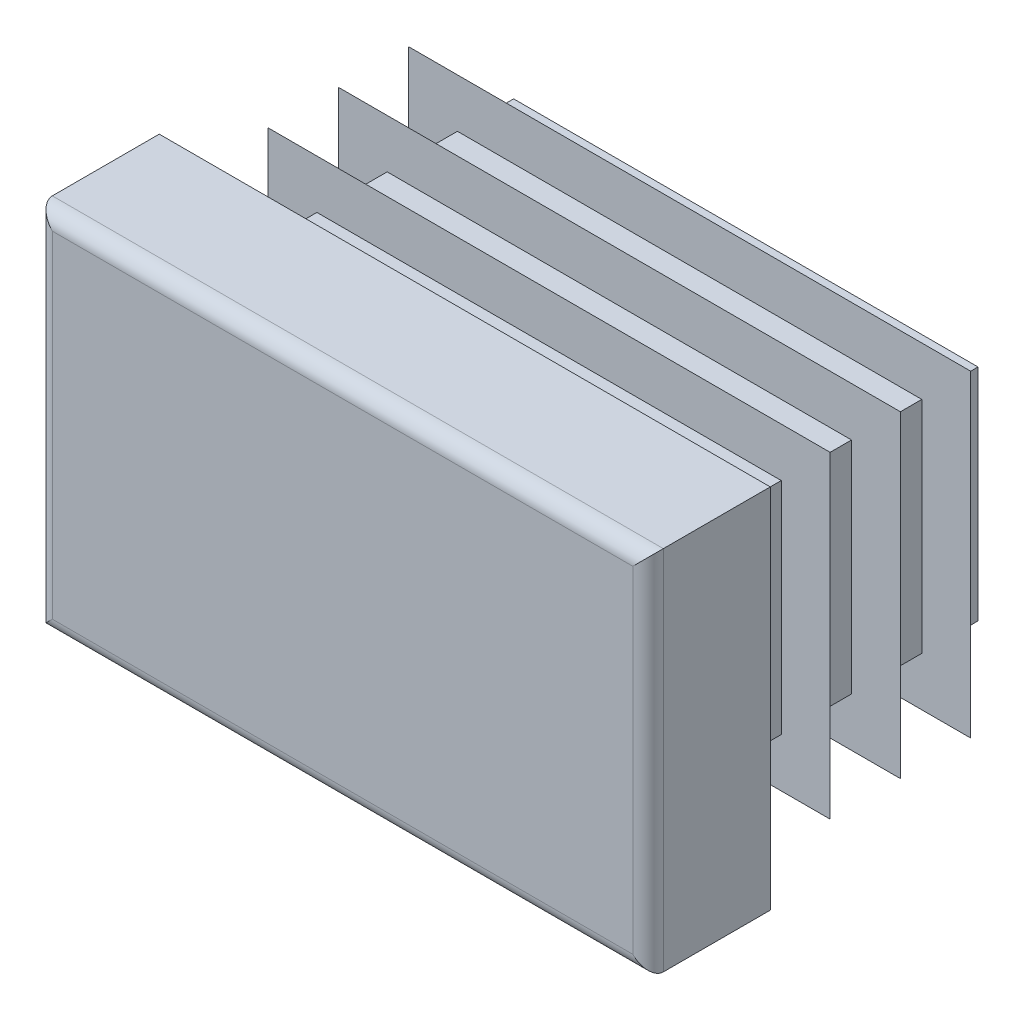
ISO-10303-21;
HEADER;
FILE_DESCRIPTION(('STEP AP214'),'2;1');
FILE_NAME('part.step','',(''),(''),'','','');
FILE_SCHEMA(('AUTOMOTIVE_DESIGN { 1 0 10303 214 1 1 1 1 }'));
ENDSEC;
DATA;
#1=APPLICATION_CONTEXT('core data for automotive mechanical design processes');
#2=APPLICATION_PROTOCOL_DEFINITION('international standard','automotive_design',2000,#1);
#3=PRODUCT_CONTEXT('',#1,'mechanical');
#4=PRODUCT('Part','Part','',(#3));
#5=PRODUCT_RELATED_PRODUCT_CATEGORY('part','',(#4));
#6=PRODUCT_DEFINITION_FORMATION('','',#4);
#7=PRODUCT_DEFINITION_CONTEXT('part definition',#1,'design');
#8=PRODUCT_DEFINITION('design','',#6,#7);
#9=PRODUCT_DEFINITION_SHAPE('','',#8);
#10=(LENGTH_UNIT() NAMED_UNIT(*) SI_UNIT(.MILLI.,.METRE.));
#11=(NAMED_UNIT(*) PLANE_ANGLE_UNIT() SI_UNIT($,.RADIAN.));
#12=(NAMED_UNIT(*) SI_UNIT($,.STERADIAN.) SOLID_ANGLE_UNIT());
#13=UNCERTAINTY_MEASURE_WITH_UNIT(LENGTH_MEASURE(1.E-05),#10,'distance_accuracy_value','');
#14=(GEOMETRIC_REPRESENTATION_CONTEXT(3) GLOBAL_UNCERTAINTY_ASSIGNED_CONTEXT((#13)) GLOBAL_UNIT_ASSIGNED_CONTEXT((#10,
#11,#12)) REPRESENTATION_CONTEXT('',''));
#15=CARTESIAN_POINT('',(0.,0.,0.));
#16=DIRECTION('',(0.,0.,1.));
#17=DIRECTION('',(1.,0.,0.));
#18=AXIS2_PLACEMENT_3D('',#15,#16,#17);
#19=CARTESIAN_POINT('',(11.875,-7.5,5.));
#20=DIRECTION('',(0.,0.,-1.));
#21=DIRECTION('',(0.,1.,0.));
#22=AXIS2_PLACEMENT_3D('',#19,#20,#21);
#23=PLANE('',#22);
#24=DIRECTION('',(0.,1.,0.));
#25=VECTOR('',#24,1.);
#26=CARTESIAN_POINT('',(-11.875,-7.5,5.));
#27=LINE('',#26,#25);
#28=CARTESIAN_POINT('',(-11.875,-6.875,5.));
#29=VERTEX_POINT('',#28);
#30=CARTESIAN_POINT('',(-11.875,6.875,5.));
#31=VERTEX_POINT('',#30);
#32=EDGE_CURVE('E310',#29,#31,#27,.T.);
#33=ORIENTED_EDGE('',*,*,#32,.F.);
#34=DIRECTION('',(-1.,0.,0.));
#35=VECTOR('',#34,1.);
#36=CARTESIAN_POINT('',(12.5,-6.875,5.));
#37=LINE('',#36,#35);
#38=CARTESIAN_POINT('',(11.875,-6.875,5.));
#39=VERTEX_POINT('',#38);
#40=EDGE_CURVE('E482',#39,#29,#37,.T.);
#41=ORIENTED_EDGE('',*,*,#40,.F.);
#42=DIRECTION('',(0.,1.,0.));
#43=VECTOR('',#42,1.);
#44=CARTESIAN_POINT('',(11.875,-7.5,5.));
#45=LINE('',#44,#43);
#46=CARTESIAN_POINT('',(11.875,6.875,5.));
#47=VERTEX_POINT('',#46);
#48=EDGE_CURVE('E305',#39,#47,#45,.T.);
#49=ORIENTED_EDGE('',*,*,#48,.T.);
#50=DIRECTION('',(-1.,0.,0.));
#51=VECTOR('',#50,1.);
#52=CARTESIAN_POINT('',(12.5,6.875,5.));
#53=LINE('',#52,#51);
#54=EDGE_CURVE('E630',#47,#31,#53,.T.);
#55=ORIENTED_EDGE('',*,*,#54,.T.);
#56=EDGE_LOOP('',(#33,#41,#49,#55));
#57=FACE_BOUND('',#56,.T.);
#58=ADVANCED_FACE('F14',(#57),#23,.F.);
#59=CARTESIAN_POINT('',(-11.875,-7.5,4.375));
#60=DIRECTION('',(0.,1.,0.));
#61=DIRECTION('',(-1.,0.,0.));
#62=AXIS2_PLACEMENT_3D('',#59,#60,#61);
#63=CYLINDRICAL_SURFACE('',#62,0.625);
#64=DIRECTION('',(0.,1.,0.));
#65=VECTOR('',#64,1.);
#66=CARTESIAN_POINT('',(-12.5,-7.5,4.375));
#67=LINE('',#66,#65);
#68=CARTESIAN_POINT('',(-12.5,-7.5,4.375));
#69=VERTEX_POINT('',#68);
#70=CARTESIAN_POINT('',(-12.5,7.5,4.375));
#71=VERTEX_POINT('',#70);
#72=EDGE_CURVE('E402',#69,#71,#67,.T.);
#73=ORIENTED_EDGE('',*,*,#72,.F.);
#74=CARTESIAN_POINT('',(-11.875,-6.875,4.375));
#75=DIRECTION('',(-0.707106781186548,0.707106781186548,0.));
#76=DIRECTION('',(0.707106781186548,0.707106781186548,0.));
#77=AXIS2_PLACEMENT_3D('',#74,#75,#76);
#78=ELLIPSE('',#77,0.883883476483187,0.625);
#79=EDGE_CURVE('E59',#69,#29,#78,.T.);
#80=ORIENTED_EDGE('',*,*,#79,.T.);
#81=ORIENTED_EDGE('',*,*,#32,.T.);
#82=CARTESIAN_POINT('',(-11.875,6.875,4.375));
#83=DIRECTION('',(0.707106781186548,0.707106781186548,0.));
#84=DIRECTION('',(-0.707106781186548,0.707106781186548,0.));
#85=AXIS2_PLACEMENT_3D('',#82,#83,#84);
#86=ELLIPSE('',#85,0.883883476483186,0.625);
#87=EDGE_CURVE('E306',#31,#71,#86,.F.);
#88=ORIENTED_EDGE('',*,*,#87,.T.);
#89=EDGE_LOOP('',(#73,#80,#81,#88));
#90=FACE_BOUND('',#89,.T.);
#91=ADVANCED_FACE('F16',(#90),#63,.T.);
#92=CARTESIAN_POINT('',(-12.5,-7.5,4.375));
#93=DIRECTION('',(1.,0.,0.));
#94=DIRECTION('',(0.,1.,0.));
#95=AXIS2_PLACEMENT_3D('',#92,#93,#94);
#96=PLANE('',#95);
#97=DIRECTION('',(0.,0.,-1.));
#98=VECTOR('',#97,1.);
#99=CARTESIAN_POINT('',(-12.5,7.5,4.375));
#100=LINE('',#99,#98);
#101=CARTESIAN_POINT('',(-12.5,7.5,0.));
#102=VERTEX_POINT('',#101);
#103=EDGE_CURVE('E615',#71,#102,#100,.T.);
#104=ORIENTED_EDGE('',*,*,#103,.T.);
#105=DIRECTION('',(0.,1.,0.));
#106=VECTOR('',#105,1.);
#107=CARTESIAN_POINT('',(-12.5,-7.5,0.));
#108=LINE('',#107,#106);
#109=CARTESIAN_POINT('',(-12.5,-7.5,0.));
#110=VERTEX_POINT('',#109);
#111=EDGE_CURVE('E400',#110,#102,#108,.T.);
#112=ORIENTED_EDGE('',*,*,#111,.F.);
#113=DIRECTION('',(0.,0.,-1.));
#114=VECTOR('',#113,1.);
#115=CARTESIAN_POINT('',(-12.5,-7.5,4.375));
#116=LINE('',#115,#114);
#117=EDGE_CURVE('E616',#69,#110,#116,.T.);
#118=ORIENTED_EDGE('',*,*,#117,.F.);
#119=ORIENTED_EDGE('',*,*,#72,.T.);
#120=EDGE_LOOP('',(#104,#112,#118,#119));
#121=FACE_BOUND('',#120,.T.);
#122=ADVANCED_FACE('F697',(#121),#96,.F.);
#123=CARTESIAN_POINT('',(-9.5,-7.5,0.));
#124=DIRECTION('',(1.,0.,0.));
#125=DIRECTION('',(0.,1.,0.));
#126=AXIS2_PLACEMENT_3D('',#123,#124,#125);
#127=PLANE('',#126);
#128=DIRECTION('',(0.,1.,0.));
#129=VECTOR('',#128,1.);
#130=CARTESIAN_POINT('',(-9.5,-7.5,0.));
#131=LINE('',#130,#129);
#132=CARTESIAN_POINT('',(-9.5,-4.5,0.));
#133=VERTEX_POINT('',#132);
#134=CARTESIAN_POINT('',(-9.5,4.5,0.));
#135=VERTEX_POINT('',#134);
#136=EDGE_CURVE('E397',#133,#135,#131,.T.);
#137=ORIENTED_EDGE('',*,*,#136,.T.);
#138=DIRECTION('',(0.,0.,-1.));
#139=VECTOR('',#138,1.);
#140=CARTESIAN_POINT('',(-9.5,4.5,0.));
#141=LINE('',#140,#139);
#142=CARTESIAN_POINT('',(-9.5,4.5,-0.575));
#143=VERTEX_POINT('',#142);
#144=EDGE_CURVE('E495',#135,#143,#141,.T.);
#145=ORIENTED_EDGE('',*,*,#144,.T.);
#146=DIRECTION('',(0.,1.,0.));
#147=VECTOR('',#146,1.);
#148=CARTESIAN_POINT('',(-9.5,-7.5,-0.575));
#149=LINE('',#148,#147);
#150=CARTESIAN_POINT('',(-9.5,-4.5,-0.575));
#151=VERTEX_POINT('',#150);
#152=EDGE_CURVE('E394',#151,#143,#149,.T.);
#153=ORIENTED_EDGE('',*,*,#152,.F.);
#154=DIRECTION('',(0.,0.,1.));
#155=VECTOR('',#154,1.);
#156=CARTESIAN_POINT('',(-9.5,-4.5,0.));
#157=LINE('',#156,#155);
#158=EDGE_CURVE('E489',#151,#133,#157,.T.);
#159=ORIENTED_EDGE('',*,*,#158,.T.);
#160=EDGE_LOOP('',(#137,#145,#153,#159));
#161=FACE_BOUND('',#160,.T.);
#162=ADVANCED_FACE('F787',(#161),#127,.F.);
#163=CARTESIAN_POINT('',(-11.5,-7.5,-0.575));
#164=DIRECTION('',(0.342020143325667,0.,0.939692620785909));
#165=DIRECTION('',(-0.939692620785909,0.,0.342020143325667));
#166=AXIS2_PLACEMENT_3D('',#163,#164,#165);
#167=PLANE('',#166);
#168=DIRECTION('',(0.,1.,0.));
#169=VECTOR('',#168,1.);
#170=CARTESIAN_POINT('',(-11.5,-7.5,-0.575));
#171=LINE('',#170,#169);
#172=CARTESIAN_POINT('',(-11.5,-6.5,-0.575));
#173=VERTEX_POINT('',#172);
#174=CARTESIAN_POINT('',(-11.5,6.5,-0.575));
#175=VERTEX_POINT('',#174);
#176=EDGE_CURVE('E392',#173,#175,#171,.T.);
#177=ORIENTED_EDGE('',*,*,#176,.T.);
#178=DIRECTION('',(0.844349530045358,-0.43889572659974,-0.307318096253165));
#179=VECTOR('',#178,1.);
#180=CARTESIAN_POINT('',(-6.31186039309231,3.80318757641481,-2.46332838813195));
#181=LINE('',#180,#179);
#182=CARTESIAN_POINT('',(-9.5,5.46039327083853,-1.3029404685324));
#183=VERTEX_POINT('',#182);
#184=EDGE_CURVE('E519',#175,#183,#181,.T.);
#185=ORIENTED_EDGE('',*,*,#184,.T.);
#186=DIRECTION('',(0.,1.,0.));
#187=VECTOR('',#186,1.);
#188=CARTESIAN_POINT('',(-9.5,-7.5,-1.3029404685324));
#189=LINE('',#188,#187);
#190=CARTESIAN_POINT('',(-9.5,-5.46039327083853,-1.3029404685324));
#191=VERTEX_POINT('',#190);
#192=EDGE_CURVE('E389',#191,#183,#189,.T.);
#193=ORIENTED_EDGE('',*,*,#192,.F.);
#194=DIRECTION('',(-0.844349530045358,-0.438895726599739,0.307318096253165));
#195=VECTOR('',#194,1.);
#196=CARTESIAN_POINT('',(-11.8705814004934,-6.69262945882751,-0.440119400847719));
#197=LINE('',#196,#195);
#198=EDGE_CURVE('E507',#191,#173,#197,.T.);
#199=ORIENTED_EDGE('',*,*,#198,.T.);
#200=EDGE_LOOP('',(#177,#185,#193,#199));
#201=FACE_BOUND('',#200,.T.);
#202=ADVANCED_FACE('F783',(#201),#167,.F.);
#203=CARTESIAN_POINT('',(-9.5,-7.5,-1.3029404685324));
#204=DIRECTION('',(1.,0.,0.));
#205=DIRECTION('',(0.,1.,0.));
#206=AXIS2_PLACEMENT_3D('',#203,#204,#205);
#207=PLANE('',#206);
#208=ORIENTED_EDGE('',*,*,#192,.T.);
#209=DIRECTION('',(0.,-0.819152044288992,-0.573576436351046));
#210=VECTOR('',#209,1.);
#211=CARTESIAN_POINT('',(-9.5,-3.23616114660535,-7.39233342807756));
#212=LINE('',#211,#210);
#213=CARTESIAN_POINT('',(-9.5,4.5,-1.97541507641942));
#214=VERTEX_POINT('',#213);
#215=EDGE_CURVE('E516',#183,#214,#212,.T.);
#216=ORIENTED_EDGE('',*,*,#215,.T.);
#217=DIRECTION('',(0.,0.,-1.));
#218=VECTOR('',#217,1.);
#219=CARTESIAN_POINT('',(-9.5,4.5,-1.3029404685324));
#220=LINE('',#219,#218);
#221=CARTESIAN_POINT('',(-9.5,4.5,-3.45));
#222=VERTEX_POINT('',#221);
#223=EDGE_CURVE('E525',#214,#222,#220,.T.);
#224=ORIENTED_EDGE('',*,*,#223,.T.);
#225=DIRECTION('',(0.,1.,0.));
#226=VECTOR('',#225,1.);
#227=CARTESIAN_POINT('',(-9.5,-7.5,-3.45));
#228=LINE('',#227,#226);
#229=CARTESIAN_POINT('',(-9.5,-4.5,-3.45));
#230=VERTEX_POINT('',#229);
#231=EDGE_CURVE('E386',#230,#222,#228,.T.);
#232=ORIENTED_EDGE('',*,*,#231,.F.);
#233=DIRECTION('',(0.,0.,1.));
#234=VECTOR('',#233,1.);
#235=CARTESIAN_POINT('',(-9.5,-4.5,-1.3029404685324));
#236=LINE('',#235,#234);
#237=CARTESIAN_POINT('',(-9.5,-4.5,-1.97541507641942));
#238=VERTEX_POINT('',#237);
#239=EDGE_CURVE('E522',#230,#238,#236,.T.);
#240=ORIENTED_EDGE('',*,*,#239,.T.);
#241=DIRECTION('',(0.,-0.819152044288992,0.573576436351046));
#242=VECTOR('',#241,1.);
#243=CARTESIAN_POINT('',(-9.5,-6.82898992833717,-0.344638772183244));
#244=LINE('',#243,#242);
#245=EDGE_CURVE('E504',#238,#191,#244,.T.);
#246=ORIENTED_EDGE('',*,*,#245,.T.);
#247=EDGE_LOOP('',(#208,#216,#224,#232,#240,#246));
#248=FACE_BOUND('',#247,.T.);
#249=ADVANCED_FACE('F779',(#248),#207,.F.);
#250=CARTESIAN_POINT('',(-11.5,-7.5,-3.45));
#251=DIRECTION('',(0.342020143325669,0.,0.939692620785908));
#252=DIRECTION('',(-0.939692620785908,0.,0.342020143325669));
#253=AXIS2_PLACEMENT_3D('',#250,#251,#252);
#254=PLANE('',#253);
#255=DIRECTION('',(0.,1.,0.));
#256=VECTOR('',#255,1.);
#257=CARTESIAN_POINT('',(-11.5,-7.5,-3.45));
#258=LINE('',#257,#256);
#259=CARTESIAN_POINT('',(-11.5,-6.5,-3.45));
#260=VERTEX_POINT('',#259);
#261=CARTESIAN_POINT('',(-11.5,6.5,-3.45));
#262=VERTEX_POINT('',#261);
#263=EDGE_CURVE('E384',#260,#262,#258,.T.);
#264=ORIENTED_EDGE('',*,*,#263,.T.);
#265=DIRECTION('',(0.844349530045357,-0.438895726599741,-0.307318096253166));
#266=VECTOR('',#265,1.);
#267=CARTESIAN_POINT('',(-6.3118603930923,3.80318757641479,-5.33832838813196));
#268=LINE('',#267,#266);
#269=CARTESIAN_POINT('',(-9.5,5.46039327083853,-4.1779404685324));
#270=VERTEX_POINT('',#269);
#271=EDGE_CURVE('E549',#262,#270,#268,.T.);
#272=ORIENTED_EDGE('',*,*,#271,.T.);
#273=DIRECTION('',(0.,1.,0.));
#274=VECTOR('',#273,1.);
#275=CARTESIAN_POINT('',(-9.5,-7.5,-4.1779404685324));
#276=LINE('',#275,#274);
#277=CARTESIAN_POINT('',(-9.5,-5.46039327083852,-4.1779404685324));
#278=VERTEX_POINT('',#277);
#279=EDGE_CURVE('E381',#278,#270,#276,.T.);
#280=ORIENTED_EDGE('',*,*,#279,.F.);
#281=DIRECTION('',(-0.844349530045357,-0.438895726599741,0.307318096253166));
#282=VECTOR('',#281,1.);
#283=CARTESIAN_POINT('',(-11.8705814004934,-6.69262945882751,-3.31511940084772));
#284=LINE('',#283,#282);
#285=EDGE_CURVE('E537',#278,#260,#284,.T.);
#286=ORIENTED_EDGE('',*,*,#285,.T.);
#287=EDGE_LOOP('',(#264,#272,#280,#286));
#288=FACE_BOUND('',#287,.T.);
#289=ADVANCED_FACE('F775',(#288),#254,.F.);
#290=CARTESIAN_POINT('',(-9.5,-7.5,-4.1779404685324));
#291=DIRECTION('',(1.,0.,0.));
#292=DIRECTION('',(0.,1.,0.));
#293=AXIS2_PLACEMENT_3D('',#290,#291,#292);
#294=PLANE('',#293);
#295=ORIENTED_EDGE('',*,*,#279,.T.);
#296=DIRECTION('',(0.,-0.819152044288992,-0.573576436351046));
#297=VECTOR('',#296,1.);
#298=CARTESIAN_POINT('',(-9.5,-3.23616114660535,-10.2673334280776));
#299=LINE('',#298,#297);
#300=CARTESIAN_POINT('',(-9.5,4.5,-4.85041507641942));
#301=VERTEX_POINT('',#300);
#302=EDGE_CURVE('E546',#270,#301,#299,.T.);
#303=ORIENTED_EDGE('',*,*,#302,.T.);
#304=DIRECTION('',(0.,0.,-1.));
#305=VECTOR('',#304,1.);
#306=CARTESIAN_POINT('',(-9.5,4.5,-4.1779404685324));
#307=LINE('',#306,#305);
#308=CARTESIAN_POINT('',(-9.5,4.5,-6.325));
#309=VERTEX_POINT('',#308);
#310=EDGE_CURVE('E555',#301,#309,#307,.T.);
#311=ORIENTED_EDGE('',*,*,#310,.T.);
#312=DIRECTION('',(0.,1.,0.));
#313=VECTOR('',#312,1.);
#314=CARTESIAN_POINT('',(-9.5,-7.5,-6.325));
#315=LINE('',#314,#313);
#316=CARTESIAN_POINT('',(-9.5,-4.5,-6.325));
#317=VERTEX_POINT('',#316);
#318=EDGE_CURVE('E378',#317,#309,#315,.T.);
#319=ORIENTED_EDGE('',*,*,#318,.F.);
#320=DIRECTION('',(0.,0.,1.));
#321=VECTOR('',#320,1.);
#322=CARTESIAN_POINT('',(-9.5,-4.5,-4.1779404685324));
#323=LINE('',#322,#321);
#324=CARTESIAN_POINT('',(-9.5,-4.5,-4.85041507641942));
#325=VERTEX_POINT('',#324);
#326=EDGE_CURVE('E552',#317,#325,#323,.T.);
#327=ORIENTED_EDGE('',*,*,#326,.T.);
#328=DIRECTION('',(0.,-0.819152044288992,0.573576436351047));
#329=VECTOR('',#328,1.);
#330=CARTESIAN_POINT('',(-9.5,-6.82898992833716,-3.21963877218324));
#331=LINE('',#330,#329);
#332=EDGE_CURVE('E534',#325,#278,#331,.T.);
#333=ORIENTED_EDGE('',*,*,#332,.T.);
#334=EDGE_LOOP('',(#295,#303,#311,#319,#327,#333));
#335=FACE_BOUND('',#334,.T.);
#336=ADVANCED_FACE('F771',(#335),#294,.F.);
#337=CARTESIAN_POINT('',(-11.5,-7.5,-6.325));
#338=DIRECTION('',(0.342020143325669,0.,0.939692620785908));
#339=DIRECTION('',(-0.939692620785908,0.,0.342020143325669));
#340=AXIS2_PLACEMENT_3D('',#337,#338,#339);
#341=PLANE('',#340);
#342=DIRECTION('',(0.,1.,0.));
#343=VECTOR('',#342,1.);
#344=CARTESIAN_POINT('',(-11.5,-7.5,-6.325));
#345=LINE('',#344,#343);
#346=CARTESIAN_POINT('',(-11.5,-6.5,-6.325));
#347=VERTEX_POINT('',#346);
#348=CARTESIAN_POINT('',(-11.5,6.5,-6.325));
#349=VERTEX_POINT('',#348);
#350=EDGE_CURVE('E376',#347,#349,#345,.T.);
#351=ORIENTED_EDGE('',*,*,#350,.T.);
#352=DIRECTION('',(0.844349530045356,-0.438895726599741,-0.307318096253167));
#353=VECTOR('',#352,1.);
#354=CARTESIAN_POINT('',(-6.3118603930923,3.80318757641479,-8.21332838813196));
#355=LINE('',#354,#353);
#356=CARTESIAN_POINT('',(-9.5,5.46039327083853,-7.05294046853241));
#357=VERTEX_POINT('',#356);
#358=EDGE_CURVE('E579',#349,#357,#355,.T.);
#359=ORIENTED_EDGE('',*,*,#358,.T.);
#360=DIRECTION('',(0.,1.,0.));
#361=VECTOR('',#360,1.);
#362=CARTESIAN_POINT('',(-9.5,-7.5,-7.05294046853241));
#363=LINE('',#362,#361);
#364=CARTESIAN_POINT('',(-9.5,-5.46039327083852,-7.05294046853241));
#365=VERTEX_POINT('',#364);
#366=EDGE_CURVE('E373',#365,#357,#363,.T.);
#367=ORIENTED_EDGE('',*,*,#366,.F.);
#368=DIRECTION('',(-0.844349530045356,-0.438895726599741,0.307318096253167));
#369=VECTOR('',#368,1.);
#370=CARTESIAN_POINT('',(-11.8705814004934,-6.69262945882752,-6.19011940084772));
#371=LINE('',#370,#369);
#372=EDGE_CURVE('E567',#365,#347,#371,.T.);
#373=ORIENTED_EDGE('',*,*,#372,.T.);
#374=EDGE_LOOP('',(#351,#359,#367,#373));
#375=FACE_BOUND('',#374,.T.);
#376=ADVANCED_FACE('F767',(#375),#341,.F.);
#377=CARTESIAN_POINT('',(-9.5,-7.5,-7.05294046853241));
#378=DIRECTION('',(1.,0.,0.));
#379=DIRECTION('',(0.,1.,0.));
#380=AXIS2_PLACEMENT_3D('',#377,#378,#379);
#381=PLANE('',#380);
#382=ORIENTED_EDGE('',*,*,#366,.T.);
#383=DIRECTION('',(0.,-0.819152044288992,-0.573576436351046));
#384=VECTOR('',#383,1.);
#385=CARTESIAN_POINT('',(-9.5,-3.23616114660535,-13.1423334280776));
#386=LINE('',#385,#384);
#387=CARTESIAN_POINT('',(-9.5,4.5,-7.72541507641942));
#388=VERTEX_POINT('',#387);
#389=EDGE_CURVE('E576',#357,#388,#386,.T.);
#390=ORIENTED_EDGE('',*,*,#389,.T.);
#391=DIRECTION('',(0.,0.,-1.));
#392=VECTOR('',#391,1.);
#393=CARTESIAN_POINT('',(-9.5,4.5,-7.05294046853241));
#394=LINE('',#393,#392);
#395=CARTESIAN_POINT('',(-9.5,4.5,-9.2));
#396=VERTEX_POINT('',#395);
#397=EDGE_CURVE('E585',#388,#396,#394,.T.);
#398=ORIENTED_EDGE('',*,*,#397,.T.);
#399=DIRECTION('',(0.,1.,0.));
#400=VECTOR('',#399,1.);
#401=CARTESIAN_POINT('',(-9.5,-7.5,-9.2));
#402=LINE('',#401,#400);
#403=CARTESIAN_POINT('',(-9.5,-4.5,-9.2));
#404=VERTEX_POINT('',#403);
#405=EDGE_CURVE('E370',#404,#396,#402,.T.);
#406=ORIENTED_EDGE('',*,*,#405,.F.);
#407=DIRECTION('',(0.,0.,1.));
#408=VECTOR('',#407,1.);
#409=CARTESIAN_POINT('',(-9.5,-4.5,-7.05294046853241));
#410=LINE('',#409,#408);
#411=CARTESIAN_POINT('',(-9.5,-4.5,-7.72541507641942));
#412=VERTEX_POINT('',#411);
#413=EDGE_CURVE('E582',#404,#412,#410,.T.);
#414=ORIENTED_EDGE('',*,*,#413,.T.);
#415=DIRECTION('',(0.,-0.819152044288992,0.573576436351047));
#416=VECTOR('',#415,1.);
#417=CARTESIAN_POINT('',(-9.5,-6.82898992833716,-6.09463877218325));
#418=LINE('',#417,#416);
#419=EDGE_CURVE('E564',#412,#365,#418,.T.);
#420=ORIENTED_EDGE('',*,*,#419,.T.);
#421=EDGE_LOOP('',(#382,#390,#398,#406,#414,#420));
#422=FACE_BOUND('',#421,.T.);
#423=ADVANCED_FACE('F764',(#422),#381,.F.);
#424=CARTESIAN_POINT('',(-11.5,-7.5,-9.2));
#425=DIRECTION('',(0.342020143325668,0.,0.939692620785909));
#426=DIRECTION('',(-0.939692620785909,0.,0.342020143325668));
#427=AXIS2_PLACEMENT_3D('',#424,#425,#426);
#428=PLANE('',#427);
#429=DIRECTION('',(0.,1.,0.));
#430=VECTOR('',#429,1.);
#431=CARTESIAN_POINT('',(-11.5,-7.5,-9.2));
#432=LINE('',#431,#430);
#433=CARTESIAN_POINT('',(-11.5,-6.5,-9.2));
#434=VERTEX_POINT('',#433);
#435=CARTESIAN_POINT('',(-11.5,6.5,-9.2));
#436=VERTEX_POINT('',#435);
#437=EDGE_CURVE('E368',#434,#436,#432,.T.);
#438=ORIENTED_EDGE('',*,*,#437,.T.);
#439=DIRECTION('',(0.844349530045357,-0.43889572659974,-0.307318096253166));
#440=VECTOR('',#439,1.);
#441=CARTESIAN_POINT('',(-6.31186039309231,3.8031875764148,-11.0883283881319));
#442=LINE('',#441,#440);
#443=CARTESIAN_POINT('',(-9.5,5.46039327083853,-9.9279404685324));
#444=VERTEX_POINT('',#443);
#445=EDGE_CURVE('E607',#436,#444,#442,.T.);
#446=ORIENTED_EDGE('',*,*,#445,.T.);
#447=DIRECTION('',(0.,1.,0.));
#448=VECTOR('',#447,1.);
#449=CARTESIAN_POINT('',(-9.5,-7.5,-9.9279404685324));
#450=LINE('',#449,#448);
#451=CARTESIAN_POINT('',(-9.5,-5.46039327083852,-9.9279404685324));
#452=VERTEX_POINT('',#451);
#453=EDGE_CURVE('E365',#452,#444,#450,.T.);
#454=ORIENTED_EDGE('',*,*,#453,.F.);
#455=DIRECTION('',(-0.844349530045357,-0.438895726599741,0.307318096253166));
#456=VECTOR('',#455,1.);
#457=CARTESIAN_POINT('',(-11.8705814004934,-6.69262945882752,-9.06511940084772));
#458=LINE('',#457,#456);
#459=EDGE_CURVE('E595',#452,#434,#458,.T.);
#460=ORIENTED_EDGE('',*,*,#459,.T.);
#461=EDGE_LOOP('',(#438,#446,#454,#460));
#462=FACE_BOUND('',#461,.T.);
#463=ADVANCED_FACE('F675',(#462),#428,.F.);
#464=CARTESIAN_POINT('',(-9.5,-7.5,-9.9279404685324));
#465=DIRECTION('',(1.,0.,0.));
#466=DIRECTION('',(0.,1.,0.));
#467=AXIS2_PLACEMENT_3D('',#464,#465,#466);
#468=PLANE('',#467);
#469=ORIENTED_EDGE('',*,*,#453,.T.);
#470=DIRECTION('',(0.,-0.819152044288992,-0.573576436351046));
#471=VECTOR('',#470,1.);
#472=CARTESIAN_POINT('',(-9.5,-3.23616114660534,-16.0173334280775));
#473=LINE('',#472,#471);
#474=CARTESIAN_POINT('',(-9.5,4.5,-10.6004150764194));
#475=VERTEX_POINT('',#474);
#476=EDGE_CURVE('E604',#444,#475,#473,.T.);
#477=ORIENTED_EDGE('',*,*,#476,.T.);
#478=DIRECTION('',(0.,0.,-1.));
#479=VECTOR('',#478,1.);
#480=CARTESIAN_POINT('',(-9.5,4.5,-9.9279404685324));
#481=LINE('',#480,#479);
#482=CARTESIAN_POINT('',(-9.5,4.5,-11.5));
#483=VERTEX_POINT('',#482);
#484=EDGE_CURVE('E613',#475,#483,#481,.T.);
#485=ORIENTED_EDGE('',*,*,#484,.T.);
#486=DIRECTION('',(0.,1.,0.));
#487=VECTOR('',#486,1.);
#488=CARTESIAN_POINT('',(-9.5,-7.5,-11.5));
#489=LINE('',#488,#487);
#490=CARTESIAN_POINT('',(-9.5,-4.5,-11.5));
#491=VERTEX_POINT('',#490);
#492=EDGE_CURVE('E362',#491,#483,#489,.T.);
#493=ORIENTED_EDGE('',*,*,#492,.F.);
#494=DIRECTION('',(0.,0.,1.));
#495=VECTOR('',#494,1.);
#496=CARTESIAN_POINT('',(-9.5,-4.5,-9.9279404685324));
#497=LINE('',#496,#495);
#498=CARTESIAN_POINT('',(-9.5,-4.5,-10.6004150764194));
#499=VERTEX_POINT('',#498);
#500=EDGE_CURVE('E610',#491,#499,#497,.T.);
#501=ORIENTED_EDGE('',*,*,#500,.T.);
#502=DIRECTION('',(0.,-0.819152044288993,0.573576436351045));
#503=VECTOR('',#502,1.);
#504=CARTESIAN_POINT('',(-9.5,-6.82898992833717,-8.96963877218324));
#505=LINE('',#504,#503);
#506=EDGE_CURVE('E592',#499,#452,#505,.T.);
#507=ORIENTED_EDGE('',*,*,#506,.T.);
#508=EDGE_LOOP('',(#469,#477,#485,#493,#501,#507));
#509=FACE_BOUND('',#508,.T.);
#510=ADVANCED_FACE('F677',(#509),#468,.F.);
#511=CARTESIAN_POINT('',(-9.5,-7.5,-11.5));
#512=DIRECTION('',(0.,0.,1.));
#513=DIRECTION('',(0.,-1.,0.));
#514=AXIS2_PLACEMENT_3D('',#511,#512,#513);
#515=PLANE('',#514);
#516=ORIENTED_EDGE('',*,*,#492,.T.);
#517=DIRECTION('',(-1.,0.,0.));
#518=VECTOR('',#517,1.);
#519=CARTESIAN_POINT('',(12.5,4.5,-11.5));
#520=LINE('',#519,#518);
#521=CARTESIAN_POINT('',(9.5,4.5,-11.5));
#522=VERTEX_POINT('',#521);
#523=EDGE_CURVE('E438',#522,#483,#520,.T.);
#524=ORIENTED_EDGE('',*,*,#523,.F.);
#525=DIRECTION('',(0.,1.,0.));
#526=VECTOR('',#525,1.);
#527=CARTESIAN_POINT('',(9.5,-7.5,-11.5));
#528=LINE('',#527,#526);
#529=CARTESIAN_POINT('',(9.5,-4.5,-11.5));
#530=VERTEX_POINT('',#529);
#531=EDGE_CURVE('E359',#530,#522,#528,.T.);
#532=ORIENTED_EDGE('',*,*,#531,.F.);
#533=DIRECTION('',(-1.,0.,0.));
#534=VECTOR('',#533,1.);
#535=CARTESIAN_POINT('',(12.5,-4.5,-11.5));
#536=LINE('',#535,#534);
#537=EDGE_CURVE('E436',#530,#491,#536,.T.);
#538=ORIENTED_EDGE('',*,*,#537,.T.);
#539=EDGE_LOOP('',(#516,#524,#532,#538));
#540=FACE_BOUND('',#539,.T.);
#541=ADVANCED_FACE('F435',(#540),#515,.F.);
#542=CARTESIAN_POINT('',(9.5,-7.5,-11.5));
#543=DIRECTION('',(-1.,0.,0.));
#544=DIRECTION('',(0.,-1.,0.));
#545=AXIS2_PLACEMENT_3D('',#542,#543,#544);
#546=PLANE('',#545);
#547=DIRECTION('',(0.,0.,1.));
#548=VECTOR('',#547,1.);
#549=CARTESIAN_POINT('',(9.5,4.5,-11.5));
#550=LINE('',#549,#548);
#551=CARTESIAN_POINT('',(9.5,4.5,-10.6004150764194));
#552=VERTEX_POINT('',#551);
#553=EDGE_CURVE('E9',#522,#552,#550,.T.);
#554=ORIENTED_EDGE('',*,*,#553,.T.);
#555=DIRECTION('',(0.,0.819152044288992,0.573576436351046));
#556=VECTOR('',#555,1.);
#557=CARTESIAN_POINT('',(9.5,-3.97478751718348,-16.5345251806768));
#558=LINE('',#557,#556);
#559=CARTESIAN_POINT('',(9.5,5.46039327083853,-9.9279404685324));
#560=VERTEX_POINT('',#559);
#561=EDGE_CURVE('E601',#552,#560,#558,.T.);
#562=ORIENTED_EDGE('',*,*,#561,.T.);
#563=DIRECTION('',(0.,1.,0.));
#564=VECTOR('',#563,1.);
#565=CARTESIAN_POINT('',(9.5,-7.5,-9.9279404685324));
#566=LINE('',#565,#564);
#567=CARTESIAN_POINT('',(9.5,-5.46039327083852,-9.9279404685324));
#568=VERTEX_POINT('',#567);
#569=EDGE_CURVE('E356',#568,#560,#566,.T.);
#570=ORIENTED_EDGE('',*,*,#569,.F.);
#571=DIRECTION('',(0.,0.819152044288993,-0.573576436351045));
#572=VECTOR('',#571,1.);
#573=CARTESIAN_POINT('',(9.5,-6.09036355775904,-9.48683052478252));
#574=LINE('',#573,#572);
#575=CARTESIAN_POINT('',(9.5,-4.5,-10.6004150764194));
#576=VERTEX_POINT('',#575);
#577=EDGE_CURVE('E428',#568,#576,#574,.T.);
#578=ORIENTED_EDGE('',*,*,#577,.T.);
#579=DIRECTION('',(0.,0.,-1.));
#580=VECTOR('',#579,1.);
#581=CARTESIAN_POINT('',(9.5,-4.5,-11.5));
#582=LINE('',#581,#580);
#583=EDGE_CURVE('E23',#576,#530,#582,.T.);
#584=ORIENTED_EDGE('',*,*,#583,.T.);
#585=ORIENTED_EDGE('',*,*,#531,.T.);
#586=EDGE_LOOP('',(#554,#562,#570,#578,#584,#585));
#587=FACE_BOUND('',#586,.T.);
#588=ADVANCED_FACE('F426',(#587),#546,.F.);
#589=CARTESIAN_POINT('',(9.5,-7.5,-9.9279404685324));
#590=DIRECTION('',(-0.342020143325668,0.,0.939692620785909));
#591=DIRECTION('',(-0.939692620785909,0.,-0.342020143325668));
#592=AXIS2_PLACEMENT_3D('',#589,#590,#591);
#593=PLANE('',#592);
#594=ORIENTED_EDGE('',*,*,#569,.T.);
#595=DIRECTION('',(0.844349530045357,0.43889572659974,0.307318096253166));
#596=VECTOR('',#595,1.);
#597=CARTESIAN_POINT('',(4.69711931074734,2.96383972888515,-11.6760460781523));
#598=LINE('',#597,#596);
#599=CARTESIAN_POINT('',(11.5,6.5,-9.2));
#600=VERTEX_POINT('',#599);
#601=EDGE_CURVE('E598',#560,#600,#598,.T.);
#602=ORIENTED_EDGE('',*,*,#601,.T.);
#603=DIRECTION('',(0.,1.,0.));
#604=VECTOR('',#603,1.);
#605=CARTESIAN_POINT('',(11.5,-7.5,-9.2));
#606=LINE('',#605,#604);
#607=CARTESIAN_POINT('',(11.5,-6.5,-9.2));
#608=VERTEX_POINT('',#607);
#609=EDGE_CURVE('E353',#608,#600,#606,.T.);
#610=ORIENTED_EDGE('',*,*,#609,.F.);
#611=DIRECTION('',(-0.844349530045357,0.438895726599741,-0.307318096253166));
#612=VECTOR('',#611,1.);
#613=CARTESIAN_POINT('',(10.2558403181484,-5.85328161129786,-9.65283709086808));
#614=LINE('',#613,#612);
#615=EDGE_CURVE('E588',#608,#568,#614,.T.);
#616=ORIENTED_EDGE('',*,*,#615,.T.);
#617=EDGE_LOOP('',(#594,#602,#610,#616));
#618=FACE_BOUND('',#617,.T.);
#619=ADVANCED_FACE('F752',(#618),#593,.F.);
#620=CARTESIAN_POINT('',(11.5,-7.5,-9.2));
#621=DIRECTION('',(0.,0.,-1.));
#622=DIRECTION('',(0.,1.,0.));
#623=AXIS2_PLACEMENT_3D('',#620,#621,#622);
#624=PLANE('',#623);
#625=ORIENTED_EDGE('',*,*,#609,.T.);
#626=DIRECTION('',(-1.,0.,0.));
#627=VECTOR('',#626,1.);
#628=CARTESIAN_POINT('',(12.5,6.5,-9.2));
#629=LINE('',#628,#627);
#630=EDGE_CURVE('E444',#600,#436,#629,.T.);
#631=ORIENTED_EDGE('',*,*,#630,.T.);
#632=ORIENTED_EDGE('',*,*,#437,.F.);
#633=DIRECTION('',(-1.,0.,0.));
#634=VECTOR('',#633,1.);
#635=CARTESIAN_POINT('',(12.5,-6.5,-9.2));
#636=LINE('',#635,#634);
#637=EDGE_CURVE('E451',#608,#434,#636,.T.);
#638=ORIENTED_EDGE('',*,*,#637,.F.);
#639=EDGE_LOOP('',(#625,#631,#632,#638));
#640=FACE_BOUND('',#639,.T.);
#641=ORIENTED_EDGE('',*,*,#405,.T.);
#642=DIRECTION('',(-1.,0.,0.));
#643=VECTOR('',#642,1.);
#644=CARTESIAN_POINT('',(12.5,4.5,-9.2));
#645=LINE('',#644,#643);
#646=CARTESIAN_POINT('',(9.5,4.5,-9.2));
#647=VERTEX_POINT('',#646);
#648=EDGE_CURVE('E663',#647,#396,#645,.T.);
#649=ORIENTED_EDGE('',*,*,#648,.F.);
#650=DIRECTION('',(0.,1.,0.));
#651=VECTOR('',#650,1.);
#652=CARTESIAN_POINT('',(9.5,-7.5,-9.2));
#653=LINE('',#652,#651);
#654=CARTESIAN_POINT('',(9.5,-4.5,-9.2));
#655=VERTEX_POINT('',#654);
#656=EDGE_CURVE('E350',#655,#647,#653,.T.);
#657=ORIENTED_EDGE('',*,*,#656,.F.);
#658=DIRECTION('',(-1.,0.,0.));
#659=VECTOR('',#658,1.);
#660=CARTESIAN_POINT('',(12.5,-4.5,-9.2));
#661=LINE('',#660,#659);
#662=EDGE_CURVE('E453',#655,#404,#661,.T.);
#663=ORIENTED_EDGE('',*,*,#662,.T.);
#664=EDGE_LOOP('',(#641,#649,#657,#663));
#665=FACE_BOUND('',#664,.T.);
#666=ADVANCED_FACE('F667',(#640,#665),#624,.F.);
#667=CARTESIAN_POINT('',(9.5,-7.5,-9.2));
#668=DIRECTION('',(-1.,0.,0.));
#669=DIRECTION('',(0.,-1.,0.));
#670=AXIS2_PLACEMENT_3D('',#667,#668,#669);
#671=PLANE('',#670);
#672=DIRECTION('',(0.,0.,1.));
#673=VECTOR('',#672,1.);
#674=CARTESIAN_POINT('',(9.5,4.5,-9.2));
#675=LINE('',#674,#673);
#676=CARTESIAN_POINT('',(9.5,4.5,-7.72541507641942));
#677=VERTEX_POINT('',#676);
#678=EDGE_CURVE('E420',#647,#677,#675,.T.);
#679=ORIENTED_EDGE('',*,*,#678,.T.);
#680=DIRECTION('',(0.,0.819152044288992,0.573576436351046));
#681=VECTOR('',#680,1.);
#682=CARTESIAN_POINT('',(9.5,-4.24494914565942,-13.8486943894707));
#683=LINE('',#682,#681);
#684=CARTESIAN_POINT('',(9.5,5.46039327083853,-7.05294046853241));
#685=VERTEX_POINT('',#684);
#686=EDGE_CURVE('E573',#677,#685,#683,.T.);
#687=ORIENTED_EDGE('',*,*,#686,.T.);
#688=DIRECTION('',(0.,1.,0.));
#689=VECTOR('',#688,1.);
#690=CARTESIAN_POINT('',(9.5,-7.5,-7.05294046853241));
#691=LINE('',#690,#689);
#692=CARTESIAN_POINT('',(9.5,-5.46039327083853,-7.05294046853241));
#693=VERTEX_POINT('',#692);
#694=EDGE_CURVE('E347',#693,#685,#691,.T.);
#695=ORIENTED_EDGE('',*,*,#694,.F.);
#696=DIRECTION('',(0.,0.819152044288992,-0.573576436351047));
#697=VECTOR('',#696,1.);
#698=CARTESIAN_POINT('',(9.5,-5.82020192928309,-6.8009997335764));
#699=LINE('',#698,#697);
#700=CARTESIAN_POINT('',(9.5,-4.5,-7.72541507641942));
#701=VERTEX_POINT('',#700);
#702=EDGE_CURVE('E561',#693,#701,#699,.T.);
#703=ORIENTED_EDGE('',*,*,#702,.T.);
#704=DIRECTION('',(0.,0.,-1.));
#705=VECTOR('',#704,1.);
#706=CARTESIAN_POINT('',(9.5,-4.5,-9.2));
#707=LINE('',#706,#705);
#708=EDGE_CURVE('E417',#701,#655,#707,.T.);
#709=ORIENTED_EDGE('',*,*,#708,.T.);
#710=ORIENTED_EDGE('',*,*,#656,.T.);
#711=EDGE_LOOP('',(#679,#687,#695,#703,#709,#710));
#712=FACE_BOUND('',#711,.T.);
#713=ADVANCED_FACE('F745',(#712),#671,.F.);
#714=CARTESIAN_POINT('',(9.5,-7.5,-7.05294046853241));
#715=DIRECTION('',(-0.342020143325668,0.,0.939692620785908));
#716=DIRECTION('',(-0.939692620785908,0.,-0.342020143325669));
#717=AXIS2_PLACEMENT_3D('',#714,#715,#716);
#718=PLANE('',#717);
#719=ORIENTED_EDGE('',*,*,#694,.T.);
#720=DIRECTION('',(0.844349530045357,0.438895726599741,0.307318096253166));
#721=VECTOR('',#720,1.);
#722=CARTESIAN_POINT('',(4.69711931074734,2.96383972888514,-8.80104607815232));
#723=LINE('',#722,#721);
#724=CARTESIAN_POINT('',(11.5,6.5,-6.325));
#725=VERTEX_POINT('',#724);
#726=EDGE_CURVE('E570',#685,#725,#723,.T.);
#727=ORIENTED_EDGE('',*,*,#726,.T.);
#728=DIRECTION('',(0.,1.,0.));
#729=VECTOR('',#728,1.);
#730=CARTESIAN_POINT('',(11.5,-7.5,-6.325));
#731=LINE('',#730,#729);
#732=CARTESIAN_POINT('',(11.5,-6.5,-6.325));
#733=VERTEX_POINT('',#732);
#734=EDGE_CURVE('E344',#733,#725,#731,.T.);
#735=ORIENTED_EDGE('',*,*,#734,.F.);
#736=DIRECTION('',(-0.844349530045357,0.43889572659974,-0.307318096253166));
#737=VECTOR('',#736,1.);
#738=CARTESIAN_POINT('',(10.2558403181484,-5.85328161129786,-6.77783709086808));
#739=LINE('',#738,#737);
#740=EDGE_CURVE('E558',#733,#693,#739,.T.);
#741=ORIENTED_EDGE('',*,*,#740,.T.);
#742=EDGE_LOOP('',(#719,#727,#735,#741));
#743=FACE_BOUND('',#742,.T.);
#744=ADVANCED_FACE('F741',(#743),#718,.F.);
#745=CARTESIAN_POINT('',(11.5,-7.5,-6.325));
#746=DIRECTION('',(0.,0.,-1.));
#747=DIRECTION('',(0.,1.,0.));
#748=AXIS2_PLACEMENT_3D('',#745,#746,#747);
#749=PLANE('',#748);
#750=ORIENTED_EDGE('',*,*,#734,.T.);
#751=DIRECTION('',(-1.,0.,0.));
#752=VECTOR('',#751,1.);
#753=CARTESIAN_POINT('',(12.5,6.5,-6.325));
#754=LINE('',#753,#752);
#755=EDGE_CURVE('E657',#725,#349,#754,.T.);
#756=ORIENTED_EDGE('',*,*,#755,.T.);
#757=ORIENTED_EDGE('',*,*,#350,.F.);
#758=DIRECTION('',(-1.,0.,0.));
#759=VECTOR('',#758,1.);
#760=CARTESIAN_POINT('',(12.5,-6.5,-6.325));
#761=LINE('',#760,#759);
#762=EDGE_CURVE('E459',#733,#347,#761,.T.);
#763=ORIENTED_EDGE('',*,*,#762,.F.);
#764=EDGE_LOOP('',(#750,#756,#757,#763));
#765=FACE_BOUND('',#764,.T.);
#766=ORIENTED_EDGE('',*,*,#318,.T.);
#767=DIRECTION('',(-1.,0.,0.));
#768=VECTOR('',#767,1.);
#769=CARTESIAN_POINT('',(12.5,4.5,-6.325));
#770=LINE('',#769,#768);
#771=CARTESIAN_POINT('',(9.5,4.5,-6.325));
#772=VERTEX_POINT('',#771);
#773=EDGE_CURVE('E655',#772,#309,#770,.T.);
#774=ORIENTED_EDGE('',*,*,#773,.F.);
#775=DIRECTION('',(0.,1.,0.));
#776=VECTOR('',#775,1.);
#777=CARTESIAN_POINT('',(9.5,-7.5,-6.325));
#778=LINE('',#777,#776);
#779=CARTESIAN_POINT('',(9.5,-4.5,-6.325));
#780=VERTEX_POINT('',#779);
#781=EDGE_CURVE('E341',#780,#772,#778,.T.);
#782=ORIENTED_EDGE('',*,*,#781,.F.);
#783=DIRECTION('',(-1.,0.,0.));
#784=VECTOR('',#783,1.);
#785=CARTESIAN_POINT('',(12.5,-4.5,-6.325));
#786=LINE('',#785,#784);
#787=EDGE_CURVE('E461',#780,#317,#786,.T.);
#788=ORIENTED_EDGE('',*,*,#787,.T.);
#789=EDGE_LOOP('',(#766,#774,#782,#788));
#790=FACE_BOUND('',#789,.T.);
#791=ADVANCED_FACE('F737',(#765,#790),#749,.F.);
#792=CARTESIAN_POINT('',(9.5,-7.5,-6.325));
#793=DIRECTION('',(-1.,0.,0.));
#794=DIRECTION('',(0.,-1.,0.));
#795=AXIS2_PLACEMENT_3D('',#792,#793,#794);
#796=PLANE('',#795);
#797=DIRECTION('',(0.,0.,1.));
#798=VECTOR('',#797,1.);
#799=CARTESIAN_POINT('',(9.5,4.5,-6.325));
#800=LINE('',#799,#798);
#801=CARTESIAN_POINT('',(9.5,4.5,-4.85041507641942));
#802=VERTEX_POINT('',#801);
#803=EDGE_CURVE('E414',#772,#802,#800,.T.);
#804=ORIENTED_EDGE('',*,*,#803,.T.);
#805=DIRECTION('',(0.,0.819152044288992,0.573576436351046));
#806=VECTOR('',#805,1.);
#807=CARTESIAN_POINT('',(9.5,-4.24494914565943,-10.9736943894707));
#808=LINE('',#807,#806);
#809=CARTESIAN_POINT('',(9.5,5.46039327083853,-4.1779404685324));
#810=VERTEX_POINT('',#809);
#811=EDGE_CURVE('E543',#802,#810,#808,.T.);
#812=ORIENTED_EDGE('',*,*,#811,.T.);
#813=DIRECTION('',(0.,1.,0.));
#814=VECTOR('',#813,1.);
#815=CARTESIAN_POINT('',(9.5,-7.5,-4.1779404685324));
#816=LINE('',#815,#814);
#817=CARTESIAN_POINT('',(9.5,-5.46039327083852,-4.1779404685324));
#818=VERTEX_POINT('',#817);
#819=EDGE_CURVE('E338',#818,#810,#816,.T.);
#820=ORIENTED_EDGE('',*,*,#819,.F.);
#821=DIRECTION('',(0.,0.819152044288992,-0.573576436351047));
#822=VECTOR('',#821,1.);
#823=CARTESIAN_POINT('',(9.5,-5.82020192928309,-3.9259997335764));
#824=LINE('',#823,#822);
#825=CARTESIAN_POINT('',(9.5,-4.5,-4.85041507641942));
#826=VERTEX_POINT('',#825);
#827=EDGE_CURVE('E531',#818,#826,#824,.T.);
#828=ORIENTED_EDGE('',*,*,#827,.T.);
#829=DIRECTION('',(0.,0.,-1.));
#830=VECTOR('',#829,1.);
#831=CARTESIAN_POINT('',(9.5,-4.5,-6.325));
#832=LINE('',#831,#830);
#833=EDGE_CURVE('E411',#826,#780,#832,.T.);
#834=ORIENTED_EDGE('',*,*,#833,.T.);
#835=ORIENTED_EDGE('',*,*,#781,.T.);
#836=EDGE_LOOP('',(#804,#812,#820,#828,#834,#835));
#837=FACE_BOUND('',#836,.T.);
#838=ADVANCED_FACE('F733',(#837),#796,.F.);
#839=CARTESIAN_POINT('',(9.5,-7.5,-4.1779404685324));
#840=DIRECTION('',(-0.342020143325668,0.,0.939692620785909));
#841=DIRECTION('',(-0.939692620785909,0.,-0.342020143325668));
#842=AXIS2_PLACEMENT_3D('',#839,#840,#841);
#843=PLANE('',#842);
#844=ORIENTED_EDGE('',*,*,#819,.T.);
#845=DIRECTION('',(0.844349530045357,0.43889572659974,0.307318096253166));
#846=VECTOR('',#845,1.);
#847=CARTESIAN_POINT('',(4.69711931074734,2.96383972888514,-5.92604607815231));
#848=LINE('',#847,#846);
#849=CARTESIAN_POINT('',(11.5,6.5,-3.45));
#850=VERTEX_POINT('',#849);
#851=EDGE_CURVE('E540',#810,#850,#848,.T.);
#852=ORIENTED_EDGE('',*,*,#851,.T.);
#853=DIRECTION('',(0.,1.,0.));
#854=VECTOR('',#853,1.);
#855=CARTESIAN_POINT('',(11.5,-7.5,-3.45));
#856=LINE('',#855,#854);
#857=CARTESIAN_POINT('',(11.5,-6.5,-3.45));
#858=VERTEX_POINT('',#857);
#859=EDGE_CURVE('E335',#858,#850,#856,.T.);
#860=ORIENTED_EDGE('',*,*,#859,.F.);
#861=DIRECTION('',(-0.844349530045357,0.43889572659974,-0.307318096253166));
#862=VECTOR('',#861,1.);
#863=CARTESIAN_POINT('',(10.2558403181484,-5.85328161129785,-3.90283709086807));
#864=LINE('',#863,#862);
#865=EDGE_CURVE('E528',#858,#818,#864,.T.);
#866=ORIENTED_EDGE('',*,*,#865,.T.);
#867=EDGE_LOOP('',(#844,#852,#860,#866));
#868=FACE_BOUND('',#867,.T.);
#869=ADVANCED_FACE('F729',(#868),#843,.F.);
#870=CARTESIAN_POINT('',(11.5,-7.5,-3.45));
#871=DIRECTION('',(0.,0.,-1.));
#872=DIRECTION('',(0.,1.,0.));
#873=AXIS2_PLACEMENT_3D('',#870,#871,#872);
#874=PLANE('',#873);
#875=ORIENTED_EDGE('',*,*,#859,.T.);
#876=DIRECTION('',(-1.,0.,0.));
#877=VECTOR('',#876,1.);
#878=CARTESIAN_POINT('',(12.5,6.5,-3.45));
#879=LINE('',#878,#877);
#880=EDGE_CURVE('E649',#850,#262,#879,.T.);
#881=ORIENTED_EDGE('',*,*,#880,.T.);
#882=ORIENTED_EDGE('',*,*,#263,.F.);
#883=DIRECTION('',(-1.,0.,0.));
#884=VECTOR('',#883,1.);
#885=CARTESIAN_POINT('',(12.5,-6.5,-3.45));
#886=LINE('',#885,#884);
#887=EDGE_CURVE('E467',#858,#260,#886,.T.);
#888=ORIENTED_EDGE('',*,*,#887,.F.);
#889=EDGE_LOOP('',(#875,#881,#882,#888));
#890=FACE_BOUND('',#889,.T.);
#891=ORIENTED_EDGE('',*,*,#231,.T.);
#892=DIRECTION('',(-1.,0.,0.));
#893=VECTOR('',#892,1.);
#894=CARTESIAN_POINT('',(12.5,4.5,-3.45));
#895=LINE('',#894,#893);
#896=CARTESIAN_POINT('',(9.5,4.5,-3.45));
#897=VERTEX_POINT('',#896);
#898=EDGE_CURVE('E647',#897,#222,#895,.T.);
#899=ORIENTED_EDGE('',*,*,#898,.F.);
#900=DIRECTION('',(0.,1.,0.));
#901=VECTOR('',#900,1.);
#902=CARTESIAN_POINT('',(9.5,-7.5,-3.45));
#903=LINE('',#902,#901);
#904=CARTESIAN_POINT('',(9.5,-4.5,-3.45));
#905=VERTEX_POINT('',#904);
#906=EDGE_CURVE('E332',#905,#897,#903,.T.);
#907=ORIENTED_EDGE('',*,*,#906,.F.);
#908=DIRECTION('',(-1.,0.,0.));
#909=VECTOR('',#908,1.);
#910=CARTESIAN_POINT('',(12.5,-4.5,-3.45));
#911=LINE('',#910,#909);
#912=EDGE_CURVE('E469',#905,#230,#911,.T.);
#913=ORIENTED_EDGE('',*,*,#912,.T.);
#914=EDGE_LOOP('',(#891,#899,#907,#913));
#915=FACE_BOUND('',#914,.T.);
#916=ADVANCED_FACE('F725',(#890,#915),#874,.F.);
#917=CARTESIAN_POINT('',(9.5,-7.5,-3.45));
#918=DIRECTION('',(-1.,0.,0.));
#919=DIRECTION('',(0.,-1.,0.));
#920=AXIS2_PLACEMENT_3D('',#917,#918,#919);
#921=PLANE('',#920);
#922=DIRECTION('',(0.,0.,1.));
#923=VECTOR('',#922,1.);
#924=CARTESIAN_POINT('',(9.5,4.5,-3.45));
#925=LINE('',#924,#923);
#926=CARTESIAN_POINT('',(9.5,4.5,-1.97541507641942));
#927=VERTEX_POINT('',#926);
#928=EDGE_CURVE('E408',#897,#927,#925,.T.);
#929=ORIENTED_EDGE('',*,*,#928,.T.);
#930=DIRECTION('',(0.,0.819152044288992,0.573576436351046));
#931=VECTOR('',#930,1.);
#932=CARTESIAN_POINT('',(9.5,-4.24494914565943,-8.09869438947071));
#933=LINE('',#932,#931);
#934=CARTESIAN_POINT('',(9.5,5.46039327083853,-1.3029404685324));
#935=VERTEX_POINT('',#934);
#936=EDGE_CURVE('E513',#927,#935,#933,.T.);
#937=ORIENTED_EDGE('',*,*,#936,.T.);
#938=DIRECTION('',(0.,1.,0.));
#939=VECTOR('',#938,1.);
#940=CARTESIAN_POINT('',(9.5,-7.5,-1.3029404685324));
#941=LINE('',#940,#939);
#942=CARTESIAN_POINT('',(9.5,-5.46039327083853,-1.3029404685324));
#943=VERTEX_POINT('',#942);
#944=EDGE_CURVE('E329',#943,#935,#941,.T.);
#945=ORIENTED_EDGE('',*,*,#944,.F.);
#946=DIRECTION('',(0.,0.819152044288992,-0.573576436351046));
#947=VECTOR('',#946,1.);
#948=CARTESIAN_POINT('',(9.5,-5.82020192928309,-1.0509997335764));
#949=LINE('',#948,#947);
#950=CARTESIAN_POINT('',(9.5,-4.5,-1.97541507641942));
#951=VERTEX_POINT('',#950);
#952=EDGE_CURVE('E501',#943,#951,#949,.T.);
#953=ORIENTED_EDGE('',*,*,#952,.T.);
#954=DIRECTION('',(0.,0.,-1.));
#955=VECTOR('',#954,1.);
#956=CARTESIAN_POINT('',(9.5,-4.5,-3.45));
#957=LINE('',#956,#955);
#958=EDGE_CURVE('E405',#951,#905,#957,.T.);
#959=ORIENTED_EDGE('',*,*,#958,.T.);
#960=ORIENTED_EDGE('',*,*,#906,.T.);
#961=EDGE_LOOP('',(#929,#937,#945,#953,#959,#960));
#962=FACE_BOUND('',#961,.T.);
#963=ADVANCED_FACE('F721',(#962),#921,.F.);
#964=CARTESIAN_POINT('',(9.5,-7.5,-1.3029404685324));
#965=DIRECTION('',(-0.342020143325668,0.,0.939692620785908));
#966=DIRECTION('',(-0.939692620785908,0.,-0.342020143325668));
#967=AXIS2_PLACEMENT_3D('',#964,#965,#966);
#968=PLANE('',#967);
#969=ORIENTED_EDGE('',*,*,#944,.T.);
#970=DIRECTION('',(0.844349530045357,0.438895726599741,0.307318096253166));
#971=VECTOR('',#970,1.);
#972=CARTESIAN_POINT('',(4.69711931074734,2.96383972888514,-3.05104607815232));
#973=LINE('',#972,#971);
#974=CARTESIAN_POINT('',(11.5,6.5,-0.575));
#975=VERTEX_POINT('',#974);
#976=EDGE_CURVE('E510',#935,#975,#973,.T.);
#977=ORIENTED_EDGE('',*,*,#976,.T.);
#978=DIRECTION('',(0.,1.,0.));
#979=VECTOR('',#978,1.);
#980=CARTESIAN_POINT('',(11.5,-7.5,-0.575));
#981=LINE('',#980,#979);
#982=CARTESIAN_POINT('',(11.5,-6.5,-0.575));
#983=VERTEX_POINT('',#982);
#984=EDGE_CURVE('E326',#983,#975,#981,.T.);
#985=ORIENTED_EDGE('',*,*,#984,.F.);
#986=DIRECTION('',(-0.844349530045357,0.43889572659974,-0.307318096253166));
#987=VECTOR('',#986,1.);
#988=CARTESIAN_POINT('',(10.2558403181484,-5.85328161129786,-1.02783709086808));
#989=LINE('',#988,#987);
#990=EDGE_CURVE('E498',#983,#943,#989,.T.);
#991=ORIENTED_EDGE('',*,*,#990,.T.);
#992=EDGE_LOOP('',(#969,#977,#985,#991));
#993=FACE_BOUND('',#992,.T.);
#994=ADVANCED_FACE('F717',(#993),#968,.F.);
#995=CARTESIAN_POINT('',(11.5,-7.5,-0.575));
#996=DIRECTION('',(0.,0.,-1.));
#997=DIRECTION('',(0.,1.,0.));
#998=AXIS2_PLACEMENT_3D('',#995,#996,#997);
#999=PLANE('',#998);
#1000=ORIENTED_EDGE('',*,*,#984,.T.);
#1001=DIRECTION('',(-1.,0.,0.));
#1002=VECTOR('',#1001,1.);
#1003=CARTESIAN_POINT('',(12.5,6.5,-0.575));
#1004=LINE('',#1003,#1002);
#1005=EDGE_CURVE('E641',#975,#175,#1004,.T.);
#1006=ORIENTED_EDGE('',*,*,#1005,.T.);
#1007=ORIENTED_EDGE('',*,*,#176,.F.);
#1008=DIRECTION('',(-1.,0.,0.));
#1009=VECTOR('',#1008,1.);
#1010=CARTESIAN_POINT('',(12.5,-6.5,-0.575));
#1011=LINE('',#1010,#1009);
#1012=EDGE_CURVE('E475',#983,#173,#1011,.T.);
#1013=ORIENTED_EDGE('',*,*,#1012,.F.);
#1014=EDGE_LOOP('',(#1000,#1006,#1007,#1013));
#1015=FACE_BOUND('',#1014,.T.);
#1016=ORIENTED_EDGE('',*,*,#152,.T.);
#1017=DIRECTION('',(-1.,0.,0.));
#1018=VECTOR('',#1017,1.);
#1019=CARTESIAN_POINT('',(12.5,4.5,-0.575));
#1020=LINE('',#1019,#1018);
#1021=CARTESIAN_POINT('',(9.5,4.5,-0.575));
#1022=VERTEX_POINT('',#1021);
#1023=EDGE_CURVE('E639',#1022,#143,#1020,.T.);
#1024=ORIENTED_EDGE('',*,*,#1023,.F.);
#1025=DIRECTION('',(0.,1.,0.));
#1026=VECTOR('',#1025,1.);
#1027=CARTESIAN_POINT('',(9.5,-7.5,-0.575));
#1028=LINE('',#1027,#1026);
#1029=CARTESIAN_POINT('',(9.5,-4.5,-0.575));
#1030=VERTEX_POINT('',#1029);
#1031=EDGE_CURVE('E323',#1030,#1022,#1028,.T.);
#1032=ORIENTED_EDGE('',*,*,#1031,.F.);
#1033=DIRECTION('',(-1.,0.,0.));
#1034=VECTOR('',#1033,1.);
#1035=CARTESIAN_POINT('',(12.5,-4.5,-0.575));
#1036=LINE('',#1035,#1034);
#1037=EDGE_CURVE('E477',#1030,#151,#1036,.T.);
#1038=ORIENTED_EDGE('',*,*,#1037,.T.);
#1039=EDGE_LOOP('',(#1016,#1024,#1032,#1038));
#1040=FACE_BOUND('',#1039,.T.);
#1041=ADVANCED_FACE('F713',(#1015,#1040),#999,.F.);
#1042=CARTESIAN_POINT('',(9.5,-7.5,-0.575));
#1043=DIRECTION('',(-1.,0.,0.));
#1044=DIRECTION('',(0.,-1.,0.));
#1045=AXIS2_PLACEMENT_3D('',#1042,#1043,#1044);
#1046=PLANE('',#1045);
#1047=ORIENTED_EDGE('',*,*,#1031,.T.);
#1048=DIRECTION('',(0.,0.,1.));
#1049=VECTOR('',#1048,1.);
#1050=CARTESIAN_POINT('',(9.5,4.5,-0.575));
#1051=LINE('',#1050,#1049);
#1052=CARTESIAN_POINT('',(9.5,4.5,0.));
#1053=VERTEX_POINT('',#1052);
#1054=EDGE_CURVE('E492',#1022,#1053,#1051,.T.);
#1055=ORIENTED_EDGE('',*,*,#1054,.T.);
#1056=DIRECTION('',(0.,1.,0.));
#1057=VECTOR('',#1056,1.);
#1058=CARTESIAN_POINT('',(9.5,-7.5,0.));
#1059=LINE('',#1058,#1057);
#1060=CARTESIAN_POINT('',(9.5,-4.5,0.));
#1061=VERTEX_POINT('',#1060);
#1062=EDGE_CURVE('E316',#1061,#1053,#1059,.T.);
#1063=ORIENTED_EDGE('',*,*,#1062,.F.);
#1064=DIRECTION('',(0.,0.,-1.));
#1065=VECTOR('',#1064,1.);
#1066=CARTESIAN_POINT('',(9.5,-4.5,-0.575));
#1067=LINE('',#1066,#1065);
#1068=EDGE_CURVE('E486',#1061,#1030,#1067,.T.);
#1069=ORIENTED_EDGE('',*,*,#1068,.T.);
#1070=EDGE_LOOP('',(#1047,#1055,#1063,#1069));
#1071=FACE_BOUND('',#1070,.T.);
#1072=ADVANCED_FACE('F709',(#1071),#1046,.F.);
#1073=CARTESIAN_POINT('',(9.5,-7.5,0.));
#1074=DIRECTION('',(0.,0.,1.));
#1075=DIRECTION('',(0.,-1.,0.));
#1076=AXIS2_PLACEMENT_3D('',#1073,#1074,#1075);
#1077=PLANE('',#1076);
#1078=DIRECTION('',(-1.,0.,0.));
#1079=VECTOR('',#1078,1.);
#1080=CARTESIAN_POINT('',(12.5,4.5,0.));
#1081=LINE('',#1080,#1079);
#1082=EDGE_CURVE('E634',#1053,#135,#1081,.T.);
#1083=ORIENTED_EDGE('',*,*,#1082,.T.);
#1084=ORIENTED_EDGE('',*,*,#136,.F.);
#1085=DIRECTION('',(-1.,0.,0.));
#1086=VECTOR('',#1085,1.);
#1087=CARTESIAN_POINT('',(12.5,-4.5,0.));
#1088=LINE('',#1087,#1086);
#1089=EDGE_CURVE('E296',#1061,#133,#1088,.T.);
#1090=ORIENTED_EDGE('',*,*,#1089,.F.);
#1091=ORIENTED_EDGE('',*,*,#1062,.T.);
#1092=EDGE_LOOP('',(#1083,#1084,#1090,#1091));
#1093=FACE_BOUND('',#1092,.T.);
#1094=ORIENTED_EDGE('',*,*,#111,.T.);
#1095=DIRECTION('',(1.,0.,0.));
#1096=VECTOR('',#1095,1.);
#1097=CARTESIAN_POINT('',(9.5,7.5,0.));
#1098=LINE('',#1097,#1096);
#1099=CARTESIAN_POINT('',(12.5,7.5,0.));
#1100=VERTEX_POINT('',#1099);
#1101=EDGE_CURVE('E621',#102,#1100,#1098,.T.);
#1102=ORIENTED_EDGE('',*,*,#1101,.T.);
#1103=DIRECTION('',(0.,1.,0.));
#1104=VECTOR('',#1103,1.);
#1105=CARTESIAN_POINT('',(12.5,-7.5,0.));
#1106=LINE('',#1105,#1104);
#1107=CARTESIAN_POINT('',(12.5,-7.5,0.));
#1108=VERTEX_POINT('',#1107);
#1109=EDGE_CURVE('E45',#1108,#1100,#1106,.T.);
#1110=ORIENTED_EDGE('',*,*,#1109,.F.);
#1111=DIRECTION('',(1.,0.,0.));
#1112=VECTOR('',#1111,1.);
#1113=CARTESIAN_POINT('',(-12.5,-7.5,0.));
#1114=LINE('',#1113,#1112);
#1115=EDGE_CURVE('E31',#110,#1108,#1114,.T.);
#1116=ORIENTED_EDGE('',*,*,#1115,.F.);
#1117=EDGE_LOOP('',(#1094,#1102,#1110,#1116));
#1118=FACE_BOUND('',#1117,.T.);
#1119=ADVANCED_FACE('F706',(#1093,#1118),#1077,.F.);
#1120=CARTESIAN_POINT('',(12.5,-7.5,0.));
#1121=DIRECTION('',(-1.,0.,0.));
#1122=DIRECTION('',(0.,-1.,0.));
#1123=AXIS2_PLACEMENT_3D('',#1120,#1121,#1122);
#1124=PLANE('',#1123);
#1125=DIRECTION('',(0.,0.,1.));
#1126=VECTOR('',#1125,1.);
#1127=CARTESIAN_POINT('',(12.5,7.5,0.));
#1128=LINE('',#1127,#1126);
#1129=CARTESIAN_POINT('',(12.5,7.5,4.375));
#1130=VERTEX_POINT('',#1129);
#1131=EDGE_CURVE('E314',#1100,#1130,#1128,.T.);
#1132=ORIENTED_EDGE('',*,*,#1131,.T.);
#1133=DIRECTION('',(0.,1.,0.));
#1134=VECTOR('',#1133,1.);
#1135=CARTESIAN_POINT('',(12.5,-7.5,4.375));
#1136=LINE('',#1135,#1134);
#1137=CARTESIAN_POINT('',(12.5,-7.5,4.375));
#1138=VERTEX_POINT('',#1137);
#1139=EDGE_CURVE('E303',#1138,#1130,#1136,.T.);
#1140=ORIENTED_EDGE('',*,*,#1139,.F.);
#1141=DIRECTION('',(0.,0.,1.));
#1142=VECTOR('',#1141,1.);
#1143=CARTESIAN_POINT('',(12.5,-7.5,0.));
#1144=LINE('',#1143,#1142);
#1145=EDGE_CURVE('E308',#1108,#1138,#1144,.T.);
#1146=ORIENTED_EDGE('',*,*,#1145,.F.);
#1147=ORIENTED_EDGE('',*,*,#1109,.T.);
#1148=EDGE_LOOP('',(#1132,#1140,#1146,#1147));
#1149=FACE_BOUND('',#1148,.T.);
#1150=ADVANCED_FACE('F312',(#1149),#1124,.F.);
#1151=CARTESIAN_POINT('',(11.875,-7.5,4.375));
#1152=DIRECTION('',(0.,1.,0.));
#1153=DIRECTION('',(-1.,0.,0.));
#1154=AXIS2_PLACEMENT_3D('',#1151,#1152,#1153);
#1155=CYLINDRICAL_SURFACE('',#1154,0.625);
#1156=ORIENTED_EDGE('',*,*,#48,.F.);
#1157=CARTESIAN_POINT('',(11.875,-6.875,4.375));
#1158=DIRECTION('',(0.707106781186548,0.707106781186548,0.));
#1159=DIRECTION('',(-0.707106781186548,0.707106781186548,0.));
#1160=AXIS2_PLACEMENT_3D('',#1157,#1158,#1159);
#1161=ELLIPSE('',#1160,0.883883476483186,0.625);
#1162=EDGE_CURVE('E293',#39,#1138,#1161,.T.);
#1163=ORIENTED_EDGE('',*,*,#1162,.T.);
#1164=ORIENTED_EDGE('',*,*,#1139,.T.);
#1165=CARTESIAN_POINT('',(11.875,6.875,4.375));
#1166=DIRECTION('',(-0.707106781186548,0.707106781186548,0.));
#1167=DIRECTION('',(0.707106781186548,0.707106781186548,0.));
#1168=AXIS2_PLACEMENT_3D('',#1165,#1166,#1167);
#1169=ELLIPSE('',#1168,0.883883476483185,0.625);
#1170=EDGE_CURVE('E52',#1130,#47,#1169,.F.);
#1171=ORIENTED_EDGE('',*,*,#1170,.T.);
#1172=EDGE_LOOP('',(#1156,#1163,#1164,#1171));
#1173=FACE_BOUND('',#1172,.T.);
#1174=ADVANCED_FACE('F301',(#1173),#1155,.T.);
#1175=CARTESIAN_POINT('',(-11.875,-7.5,4.375));
#1176=DIRECTION('',(0.,-1.,0.));
#1177=DIRECTION('',(1.,0.,0.));
#1178=AXIS2_PLACEMENT_3D('',#1175,#1176,#1177);
#1179=PLANE('',#1178);
#1180=DIRECTION('',(-1.,0.,0.));
#1181=VECTOR('',#1180,1.);
#1182=CARTESIAN_POINT('',(12.5,-7.5,4.375));
#1183=LINE('',#1182,#1181);
#1184=EDGE_CURVE('E290',#1138,#69,#1183,.T.);
#1185=ORIENTED_EDGE('',*,*,#1184,.T.);
#1186=ORIENTED_EDGE('',*,*,#117,.T.);
#1187=ORIENTED_EDGE('',*,*,#1115,.T.);
#1188=ORIENTED_EDGE('',*,*,#1145,.T.);
#1189=EDGE_LOOP('',(#1185,#1186,#1187,#1188));
#1190=FACE_BOUND('',#1189,.T.);
#1191=ADVANCED_FACE('F309',(#1190),#1179,.T.);
#1192=CARTESIAN_POINT('',(-11.875,7.5,4.375));
#1193=DIRECTION('',(0.,-1.,0.));
#1194=DIRECTION('',(1.,0.,0.));
#1195=AXIS2_PLACEMENT_3D('',#1192,#1193,#1194);
#1196=PLANE('',#1195);
#1197=ORIENTED_EDGE('',*,*,#103,.F.);
#1198=DIRECTION('',(-1.,0.,0.));
#1199=VECTOR('',#1198,1.);
#1200=CARTESIAN_POINT('',(12.5,7.5,4.375));
#1201=LINE('',#1200,#1199);
#1202=EDGE_CURVE('E631',#1130,#71,#1201,.T.);
#1203=ORIENTED_EDGE('',*,*,#1202,.F.);
#1204=ORIENTED_EDGE('',*,*,#1131,.F.);
#1205=ORIENTED_EDGE('',*,*,#1101,.F.);
#1206=EDGE_LOOP('',(#1197,#1203,#1204,#1205));
#1207=FACE_BOUND('',#1206,.T.);
#1208=ADVANCED_FACE('F700',(#1207),#1196,.F.);
#1209=CARTESIAN_POINT('',(12.5,4.5,-0.575));
#1210=DIRECTION('',(0.,-1.,0.));
#1211=DIRECTION('',(1.,0.,0.));
#1212=AXIS2_PLACEMENT_3D('',#1209,#1210,#1211);
#1213=PLANE('',#1212);
#1214=ORIENTED_EDGE('',*,*,#1082,.F.);
#1215=ORIENTED_EDGE('',*,*,#1054,.F.);
#1216=ORIENTED_EDGE('',*,*,#1023,.T.);
#1217=ORIENTED_EDGE('',*,*,#144,.F.);
#1218=EDGE_LOOP('',(#1214,#1215,#1216,#1217));
#1219=FACE_BOUND('',#1218,.T.);
#1220=ADVANCED_FACE('F812',(#1219),#1213,.F.);
#1221=CARTESIAN_POINT('',(12.5,4.5,-1.97541507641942));
#1222=DIRECTION('',(0.,-0.573576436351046,0.819152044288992));
#1223=DIRECTION('',(0.,-0.819152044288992,-0.573576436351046));
#1224=AXIS2_PLACEMENT_3D('',#1221,#1222,#1223);
#1225=PLANE('',#1224);
#1226=ORIENTED_EDGE('',*,*,#1005,.F.);
#1227=ORIENTED_EDGE('',*,*,#976,.F.);
#1228=ORIENTED_EDGE('',*,*,#936,.F.);
#1229=DIRECTION('',(-1.,0.,0.));
#1230=VECTOR('',#1229,1.);
#1231=CARTESIAN_POINT('',(12.5,4.5,-1.97541507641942));
#1232=LINE('',#1231,#1230);
#1233=EDGE_CURVE('E644',#927,#214,#1232,.T.);
#1234=ORIENTED_EDGE('',*,*,#1233,.T.);
#1235=ORIENTED_EDGE('',*,*,#215,.F.);
#1236=ORIENTED_EDGE('',*,*,#184,.F.);
#1237=EDGE_LOOP('',(#1226,#1227,#1228,#1234,#1235,#1236));
#1238=FACE_BOUND('',#1237,.T.);
#1239=ADVANCED_FACE('F815',(#1238),#1225,.F.);
#1240=CARTESIAN_POINT('',(12.5,4.5,-3.45));
#1241=DIRECTION('',(0.,-1.,0.));
#1242=DIRECTION('',(1.,0.,0.));
#1243=AXIS2_PLACEMENT_3D('',#1240,#1241,#1242);
#1244=PLANE('',#1243);
#1245=ORIENTED_EDGE('',*,*,#1233,.F.);
#1246=ORIENTED_EDGE('',*,*,#928,.F.);
#1247=ORIENTED_EDGE('',*,*,#898,.T.);
#1248=ORIENTED_EDGE('',*,*,#223,.F.);
#1249=EDGE_LOOP('',(#1245,#1246,#1247,#1248));
#1250=FACE_BOUND('',#1249,.T.);
#1251=ADVANCED_FACE('F819',(#1250),#1244,.F.);
#1252=CARTESIAN_POINT('',(12.5,4.5,-4.85041507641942));
#1253=DIRECTION('',(0.,-0.573576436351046,0.819152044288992));
#1254=DIRECTION('',(0.,-0.819152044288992,-0.573576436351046));
#1255=AXIS2_PLACEMENT_3D('',#1252,#1253,#1254);
#1256=PLANE('',#1255);
#1257=ORIENTED_EDGE('',*,*,#880,.F.);
#1258=ORIENTED_EDGE('',*,*,#851,.F.);
#1259=ORIENTED_EDGE('',*,*,#811,.F.);
#1260=DIRECTION('',(-1.,0.,0.));
#1261=VECTOR('',#1260,1.);
#1262=CARTESIAN_POINT('',(12.5,4.5,-4.85041507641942));
#1263=LINE('',#1262,#1261);
#1264=EDGE_CURVE('E652',#802,#301,#1263,.T.);
#1265=ORIENTED_EDGE('',*,*,#1264,.T.);
#1266=ORIENTED_EDGE('',*,*,#302,.F.);
#1267=ORIENTED_EDGE('',*,*,#271,.F.);
#1268=EDGE_LOOP('',(#1257,#1258,#1259,#1265,#1266,#1267));
#1269=FACE_BOUND('',#1268,.T.);
#1270=ADVANCED_FACE('F823',(#1269),#1256,.F.);
#1271=CARTESIAN_POINT('',(12.5,4.5,-6.325));
#1272=DIRECTION('',(0.,-1.,0.));
#1273=DIRECTION('',(1.,0.,0.));
#1274=AXIS2_PLACEMENT_3D('',#1271,#1272,#1273);
#1275=PLANE('',#1274);
#1276=ORIENTED_EDGE('',*,*,#1264,.F.);
#1277=ORIENTED_EDGE('',*,*,#803,.F.);
#1278=ORIENTED_EDGE('',*,*,#773,.T.);
#1279=ORIENTED_EDGE('',*,*,#310,.F.);
#1280=EDGE_LOOP('',(#1276,#1277,#1278,#1279));
#1281=FACE_BOUND('',#1280,.T.);
#1282=ADVANCED_FACE('F827',(#1281),#1275,.F.);
#1283=CARTESIAN_POINT('',(12.5,4.5,-7.72541507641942));
#1284=DIRECTION('',(0.,-0.573576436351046,0.819152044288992));
#1285=DIRECTION('',(0.,-0.819152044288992,-0.573576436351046));
#1286=AXIS2_PLACEMENT_3D('',#1283,#1284,#1285);
#1287=PLANE('',#1286);
#1288=ORIENTED_EDGE('',*,*,#755,.F.);
#1289=ORIENTED_EDGE('',*,*,#726,.F.);
#1290=ORIENTED_EDGE('',*,*,#686,.F.);
#1291=DIRECTION('',(-1.,0.,0.));
#1292=VECTOR('',#1291,1.);
#1293=CARTESIAN_POINT('',(12.5,4.5,-7.72541507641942));
#1294=LINE('',#1293,#1292);
#1295=EDGE_CURVE('E660',#677,#388,#1294,.T.);
#1296=ORIENTED_EDGE('',*,*,#1295,.T.);
#1297=ORIENTED_EDGE('',*,*,#389,.F.);
#1298=ORIENTED_EDGE('',*,*,#358,.F.);
#1299=EDGE_LOOP('',(#1288,#1289,#1290,#1296,#1297,#1298));
#1300=FACE_BOUND('',#1299,.T.);
#1301=ADVANCED_FACE('F831',(#1300),#1287,.F.);
#1302=CARTESIAN_POINT('',(12.5,4.5,-9.2));
#1303=DIRECTION('',(0.,-1.,0.));
#1304=DIRECTION('',(1.,0.,0.));
#1305=AXIS2_PLACEMENT_3D('',#1302,#1303,#1304);
#1306=PLANE('',#1305);
#1307=ORIENTED_EDGE('',*,*,#1295,.F.);
#1308=ORIENTED_EDGE('',*,*,#678,.F.);
#1309=ORIENTED_EDGE('',*,*,#648,.T.);
#1310=ORIENTED_EDGE('',*,*,#397,.F.);
#1311=EDGE_LOOP('',(#1307,#1308,#1309,#1310));
#1312=FACE_BOUND('',#1311,.T.);
#1313=ADVANCED_FACE('F835',(#1312),#1306,.F.);
#1314=CARTESIAN_POINT('',(12.5,4.5,-10.6004150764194));
#1315=DIRECTION('',(0.,-0.573576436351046,0.819152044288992));
#1316=DIRECTION('',(0.,-0.819152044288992,-0.573576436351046));
#1317=AXIS2_PLACEMENT_3D('',#1314,#1315,#1316);
#1318=PLANE('',#1317);
#1319=ORIENTED_EDGE('',*,*,#630,.F.);
#1320=ORIENTED_EDGE('',*,*,#601,.F.);
#1321=ORIENTED_EDGE('',*,*,#561,.F.);
#1322=DIRECTION('',(-1.,0.,0.));
#1323=VECTOR('',#1322,1.);
#1324=CARTESIAN_POINT('',(12.5,4.5,-10.6004150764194));
#1325=LINE('',#1324,#1323);
#1326=EDGE_CURVE('E441',#552,#475,#1325,.T.);
#1327=ORIENTED_EDGE('',*,*,#1326,.T.);
#1328=ORIENTED_EDGE('',*,*,#476,.F.);
#1329=ORIENTED_EDGE('',*,*,#445,.F.);
#1330=EDGE_LOOP('',(#1319,#1320,#1321,#1327,#1328,#1329));
#1331=FACE_BOUND('',#1330,.T.);
#1332=ADVANCED_FACE('F672',(#1331),#1318,.F.);
#1333=CARTESIAN_POINT('',(12.5,4.5,-11.5));
#1334=DIRECTION('',(0.,-1.,0.));
#1335=DIRECTION('',(1.,0.,0.));
#1336=AXIS2_PLACEMENT_3D('',#1333,#1334,#1335);
#1337=PLANE('',#1336);
#1338=ORIENTED_EDGE('',*,*,#1326,.F.);
#1339=ORIENTED_EDGE('',*,*,#553,.F.);
#1340=ORIENTED_EDGE('',*,*,#523,.T.);
#1341=ORIENTED_EDGE('',*,*,#484,.F.);
#1342=EDGE_LOOP('',(#1338,#1339,#1340,#1341));
#1343=FACE_BOUND('',#1342,.T.);
#1344=ADVANCED_FACE('F802',(#1343),#1337,.F.);
#1345=CARTESIAN_POINT('',(12.5,6.875,4.375));
#1346=DIRECTION('',(-1.,0.,0.));
#1347=DIRECTION('',(0.,-1.,0.));
#1348=AXIS2_PLACEMENT_3D('',#1345,#1346,#1347);
#1349=CYLINDRICAL_SURFACE('',#1348,0.625);
#1350=ORIENTED_EDGE('',*,*,#54,.F.);
#1351=ORIENTED_EDGE('',*,*,#1170,.F.);
#1352=ORIENTED_EDGE('',*,*,#1202,.T.);
#1353=ORIENTED_EDGE('',*,*,#87,.F.);
#1354=EDGE_LOOP('',(#1350,#1351,#1352,#1353));
#1355=FACE_BOUND('',#1354,.T.);
#1356=ADVANCED_FACE('F799',(#1355),#1349,.T.);
#1357=CARTESIAN_POINT('',(12.5,-4.5,0.));
#1358=DIRECTION('',(0.,1.,0.));
#1359=DIRECTION('',(-1.,0.,0.));
#1360=AXIS2_PLACEMENT_3D('',#1357,#1358,#1359);
#1361=PLANE('',#1360);
#1362=ORIENTED_EDGE('',*,*,#1037,.F.);
#1363=ORIENTED_EDGE('',*,*,#1068,.F.);
#1364=ORIENTED_EDGE('',*,*,#1089,.T.);
#1365=ORIENTED_EDGE('',*,*,#158,.F.);
#1366=EDGE_LOOP('',(#1362,#1363,#1364,#1365));
#1367=FACE_BOUND('',#1366,.T.);
#1368=ADVANCED_FACE('F801',(#1367),#1361,.F.);
#1369=CARTESIAN_POINT('',(12.5,-6.5,-0.575));
#1370=DIRECTION('',(0.,0.573576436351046,0.819152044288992));
#1371=DIRECTION('',(0.,-0.819152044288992,0.573576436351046));
#1372=AXIS2_PLACEMENT_3D('',#1369,#1370,#1371);
#1373=PLANE('',#1372);
#1374=ORIENTED_EDGE('',*,*,#245,.F.);
#1375=DIRECTION('',(-1.,0.,0.));
#1376=VECTOR('',#1375,1.);
#1377=CARTESIAN_POINT('',(12.5,-4.5,-1.97541507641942));
#1378=LINE('',#1377,#1376);
#1379=EDGE_CURVE('E472',#951,#238,#1378,.T.);
#1380=ORIENTED_EDGE('',*,*,#1379,.F.);
#1381=ORIENTED_EDGE('',*,*,#952,.F.);
#1382=ORIENTED_EDGE('',*,*,#990,.F.);
#1383=ORIENTED_EDGE('',*,*,#1012,.T.);
#1384=ORIENTED_EDGE('',*,*,#198,.F.);
#1385=EDGE_LOOP('',(#1374,#1380,#1381,#1382,#1383,#1384));
#1386=FACE_BOUND('',#1385,.T.);
#1387=ADVANCED_FACE('F808',(#1386),#1373,.F.);
#1388=CARTESIAN_POINT('',(12.5,-4.5,-1.97541507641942));
#1389=DIRECTION('',(0.,1.,0.));
#1390=DIRECTION('',(-1.,0.,0.));
#1391=AXIS2_PLACEMENT_3D('',#1388,#1389,#1390);
#1392=PLANE('',#1391);
#1393=ORIENTED_EDGE('',*,*,#912,.F.);
#1394=ORIENTED_EDGE('',*,*,#958,.F.);
#1395=ORIENTED_EDGE('',*,*,#1379,.T.);
#1396=ORIENTED_EDGE('',*,*,#239,.F.);
#1397=EDGE_LOOP('',(#1393,#1394,#1395,#1396));
#1398=FACE_BOUND('',#1397,.T.);
#1399=ADVANCED_FACE('F873',(#1398),#1392,.F.);
#1400=CARTESIAN_POINT('',(12.5,-6.5,-3.45));
#1401=DIRECTION('',(0.,0.573576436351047,0.819152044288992));
#1402=DIRECTION('',(0.,-0.819152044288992,0.573576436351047));
#1403=AXIS2_PLACEMENT_3D('',#1400,#1401,#1402);
#1404=PLANE('',#1403);
#1405=ORIENTED_EDGE('',*,*,#332,.F.);
#1406=DIRECTION('',(-1.,0.,0.));
#1407=VECTOR('',#1406,1.);
#1408=CARTESIAN_POINT('',(12.5,-4.5,-4.85041507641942));
#1409=LINE('',#1408,#1407);
#1410=EDGE_CURVE('E464',#826,#325,#1409,.T.);
#1411=ORIENTED_EDGE('',*,*,#1410,.F.);
#1412=ORIENTED_EDGE('',*,*,#827,.F.);
#1413=ORIENTED_EDGE('',*,*,#865,.F.);
#1414=ORIENTED_EDGE('',*,*,#887,.T.);
#1415=ORIENTED_EDGE('',*,*,#285,.F.);
#1416=EDGE_LOOP('',(#1405,#1411,#1412,#1413,#1414,#1415));
#1417=FACE_BOUND('',#1416,.T.);
#1418=ADVANCED_FACE('F883',(#1417),#1404,.F.);
#1419=CARTESIAN_POINT('',(12.5,-4.5,-4.85041507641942));
#1420=DIRECTION('',(0.,1.,0.));
#1421=DIRECTION('',(-1.,0.,0.));
#1422=AXIS2_PLACEMENT_3D('',#1419,#1420,#1421);
#1423=PLANE('',#1422);
#1424=ORIENTED_EDGE('',*,*,#787,.F.);
#1425=ORIENTED_EDGE('',*,*,#833,.F.);
#1426=ORIENTED_EDGE('',*,*,#1410,.T.);
#1427=ORIENTED_EDGE('',*,*,#326,.F.);
#1428=EDGE_LOOP('',(#1424,#1425,#1426,#1427));
#1429=FACE_BOUND('',#1428,.T.);
#1430=ADVANCED_FACE('F893',(#1429),#1423,.F.);
#1431=CARTESIAN_POINT('',(12.5,-6.5,-6.325));
#1432=DIRECTION('',(0.,0.573576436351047,0.819152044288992));
#1433=DIRECTION('',(0.,-0.819152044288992,0.573576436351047));
#1434=AXIS2_PLACEMENT_3D('',#1431,#1432,#1433);
#1435=PLANE('',#1434);
#1436=ORIENTED_EDGE('',*,*,#419,.F.);
#1437=DIRECTION('',(-1.,0.,0.));
#1438=VECTOR('',#1437,1.);
#1439=CARTESIAN_POINT('',(12.5,-4.5,-7.72541507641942));
#1440=LINE('',#1439,#1438);
#1441=EDGE_CURVE('E456',#701,#412,#1440,.T.);
#1442=ORIENTED_EDGE('',*,*,#1441,.F.);
#1443=ORIENTED_EDGE('',*,*,#702,.F.);
#1444=ORIENTED_EDGE('',*,*,#740,.F.);
#1445=ORIENTED_EDGE('',*,*,#762,.T.);
#1446=ORIENTED_EDGE('',*,*,#372,.F.);
#1447=EDGE_LOOP('',(#1436,#1442,#1443,#1444,#1445,#1446));
#1448=FACE_BOUND('',#1447,.T.);
#1449=ADVANCED_FACE('F903',(#1448),#1435,.F.);
#1450=CARTESIAN_POINT('',(12.5,-4.5,-7.72541507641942));
#1451=DIRECTION('',(0.,1.,0.));
#1452=DIRECTION('',(-1.,0.,0.));
#1453=AXIS2_PLACEMENT_3D('',#1450,#1451,#1452);
#1454=PLANE('',#1453);
#1455=ORIENTED_EDGE('',*,*,#662,.F.);
#1456=ORIENTED_EDGE('',*,*,#708,.F.);
#1457=ORIENTED_EDGE('',*,*,#1441,.T.);
#1458=ORIENTED_EDGE('',*,*,#413,.F.);
#1459=EDGE_LOOP('',(#1455,#1456,#1457,#1458));
#1460=FACE_BOUND('',#1459,.T.);
#1461=ADVANCED_FACE('F689',(#1460),#1454,.F.);
#1462=CARTESIAN_POINT('',(12.5,-6.5,-9.2));
#1463=DIRECTION('',(0.,0.573576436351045,0.819152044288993));
#1464=DIRECTION('',(0.,-0.819152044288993,0.573576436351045));
#1465=AXIS2_PLACEMENT_3D('',#1462,#1463,#1464);
#1466=PLANE('',#1465);
#1467=ORIENTED_EDGE('',*,*,#506,.F.);
#1468=DIRECTION('',(-1.,0.,0.));
#1469=VECTOR('',#1468,1.);
#1470=CARTESIAN_POINT('',(12.5,-4.5,-10.6004150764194));
#1471=LINE('',#1470,#1469);
#1472=EDGE_CURVE('E446',#576,#499,#1471,.T.);
#1473=ORIENTED_EDGE('',*,*,#1472,.F.);
#1474=ORIENTED_EDGE('',*,*,#577,.F.);
#1475=ORIENTED_EDGE('',*,*,#615,.F.);
#1476=ORIENTED_EDGE('',*,*,#637,.T.);
#1477=ORIENTED_EDGE('',*,*,#459,.F.);
#1478=EDGE_LOOP('',(#1467,#1473,#1474,#1475,#1476,#1477));
#1479=FACE_BOUND('',#1478,.T.);
#1480=ADVANCED_FACE('F679',(#1479),#1466,.F.);
#1481=CARTESIAN_POINT('',(12.5,-4.5,-10.6004150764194));
#1482=DIRECTION('',(0.,1.,0.));
#1483=DIRECTION('',(-1.,0.,0.));
#1484=AXIS2_PLACEMENT_3D('',#1481,#1482,#1483);
#1485=PLANE('',#1484);
#1486=ORIENTED_EDGE('',*,*,#537,.F.);
#1487=ORIENTED_EDGE('',*,*,#583,.F.);
#1488=ORIENTED_EDGE('',*,*,#1472,.T.);
#1489=ORIENTED_EDGE('',*,*,#500,.F.);
#1490=EDGE_LOOP('',(#1486,#1487,#1488,#1489));
#1491=FACE_BOUND('',#1490,.T.);
#1492=ADVANCED_FACE('F680',(#1491),#1485,.F.);
#1493=CARTESIAN_POINT('',(12.5,-6.875,4.375));
#1494=DIRECTION('',(-1.,0.,0.));
#1495=DIRECTION('',(0.,-1.,0.));
#1496=AXIS2_PLACEMENT_3D('',#1493,#1494,#1495);
#1497=CYLINDRICAL_SURFACE('',#1496,0.625);
#1498=ORIENTED_EDGE('',*,*,#1184,.F.);
#1499=ORIENTED_EDGE('',*,*,#1162,.F.);
#1500=ORIENTED_EDGE('',*,*,#40,.T.);
#1501=ORIENTED_EDGE('',*,*,#79,.F.);
#1502=EDGE_LOOP('',(#1498,#1499,#1500,#1501));
#1503=FACE_BOUND('',#1502,.T.);
#1504=ADVANCED_FACE('F292',(#1503),#1497,.T.);
#1505=CLOSED_SHELL('',(#58,#91,#122,#162,#202,#249,#289,#336,#376,#423,#463,#510,#541,#588,#619,
#666,#713,#744,#791,#838,#869,#916,#963,#994,#1041,#1072,#1119,#1150,#1174,#1191,#1208,#1220,
#1239,#1251,#1270,#1282,#1301,#1313,#1332,#1344,#1356,#1368,#1387,#1399,#1418,#1430,#1449,#1461,
#1480,#1492,#1504));
#1506=MANIFOLD_SOLID_BREP('B1',#1505);
#1507=ADVANCED_BREP_SHAPE_REPRESENTATION('',(#18,#1506),#14);
#1508=SHAPE_DEFINITION_REPRESENTATION(#9,#1507);
ENDSEC;
END-ISO-10303-21;
